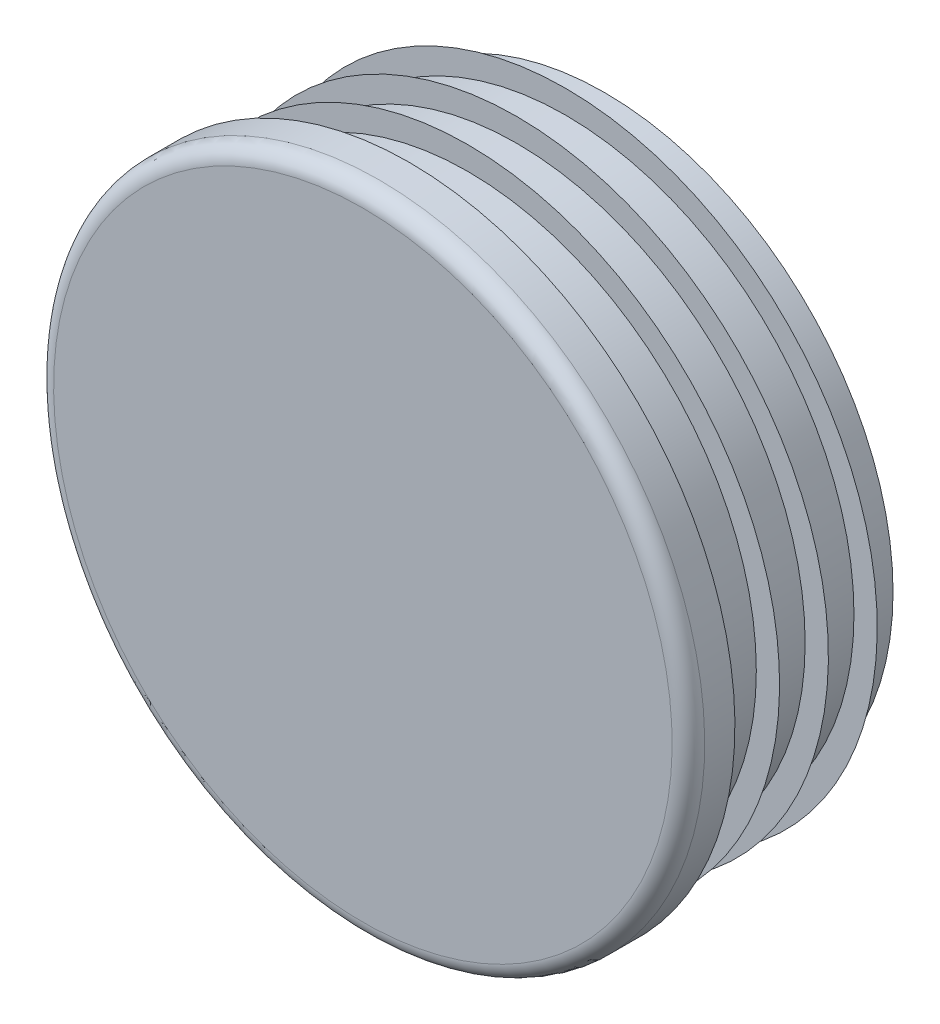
ISO-10303-21;
HEADER;
FILE_DESCRIPTION(('STEP AP214'),'2;1');
FILE_NAME('part.step','',(''),(''),'','','');
FILE_SCHEMA(('AUTOMOTIVE_DESIGN { 1 0 10303 214 1 1 1 1 }'));
ENDSEC;
DATA;
#1=APPLICATION_CONTEXT('core data for automotive mechanical design processes');
#2=APPLICATION_PROTOCOL_DEFINITION('international standard','automotive_design',2000,#1);
#3=PRODUCT_CONTEXT('',#1,'mechanical');
#4=PRODUCT('Part','Part','',(#3));
#5=PRODUCT_RELATED_PRODUCT_CATEGORY('part','',(#4));
#6=PRODUCT_DEFINITION_FORMATION('','',#4);
#7=PRODUCT_DEFINITION_CONTEXT('part definition',#1,'design');
#8=PRODUCT_DEFINITION('design','',#6,#7);
#9=PRODUCT_DEFINITION_SHAPE('','',#8);
#10=(LENGTH_UNIT() NAMED_UNIT(*) SI_UNIT(.MILLI.,.METRE.));
#11=(NAMED_UNIT(*) PLANE_ANGLE_UNIT() SI_UNIT($,.RADIAN.));
#12=(NAMED_UNIT(*) SI_UNIT($,.STERADIAN.) SOLID_ANGLE_UNIT());
#13=UNCERTAINTY_MEASURE_WITH_UNIT(LENGTH_MEASURE(1.E-05),#10,'distance_accuracy_value','');
#14=(GEOMETRIC_REPRESENTATION_CONTEXT(3) GLOBAL_UNCERTAINTY_ASSIGNED_CONTEXT((#13)) GLOBAL_UNIT_ASSIGNED_CONTEXT((#10,
#11,#12)) REPRESENTATION_CONTEXT('',''));
#15=CARTESIAN_POINT('',(0.,0.,0.));
#16=DIRECTION('',(0.,0.,1.));
#17=DIRECTION('',(1.,0.,0.));
#18=AXIS2_PLACEMENT_3D('',#15,#16,#17);
#19=CARTESIAN_POINT('',(0.,0.,5.));
#20=DIRECTION('',(0.,0.,-1.));
#21=DIRECTION('',(0.,1.,0.));
#22=AXIS2_PLACEMENT_3D('',#19,#20,#21);
#23=PLANE('',#22);
#24=CARTESIAN_POINT('',(0.,0.,5.));
#25=DIRECTION('',(0.,0.,-1.));
#26=DIRECTION('',(0.,1.,0.));
#27=AXIS2_PLACEMENT_3D('',#24,#25,#26);
#28=CIRCLE('',#27,33.25);
#29=CARTESIAN_POINT('',(0.,33.25,5.));
#30=VERTEX_POINT('',#29);
#31=EDGE_CURVE('E8',#30,#30,#28,.T.);
#32=ORIENTED_EDGE('',*,*,#31,.F.);
#33=EDGE_LOOP('',(#32));
#34=FACE_BOUND('',#33,.T.);
#35=ADVANCED_FACE('F12',(#34),#23,.F.);
#36=CARTESIAN_POINT('',(0.,0.,3.25));
#37=DIRECTION('',(0.,0.,-1.));
#38=DIRECTION('',(0.,1.,0.));
#39=AXIS2_PLACEMENT_3D('',#36,#37,#38);
#40=TOROIDAL_SURFACE('',#39,33.25,1.75);
#41=ORIENTED_EDGE('',*,*,#31,.T.);
#42=EDGE_LOOP('',(#41));
#43=FACE_BOUND('',#42,.T.);
#44=CARTESIAN_POINT('',(0.,0.,3.25000002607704));
#45=DIRECTION('',(0.,0.,-1.));
#46=DIRECTION('',(0.,1.,0.));
#47=AXIS2_PLACEMENT_3D('',#44,#45,#46);
#48=CIRCLE('',#47,35.);
#49=CARTESIAN_POINT('',(0.,35.,3.25000002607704));
#50=VERTEX_POINT('',#49);
#51=EDGE_CURVE('E18',#50,#50,#48,.T.);
#52=ORIENTED_EDGE('',*,*,#51,.F.);
#53=EDGE_LOOP('',(#52));
#54=FACE_BOUND('',#53,.T.);
#55=ADVANCED_FACE('F159',(#43,#54),#40,.T.);
#56=CARTESIAN_POINT('',(0.,0.,-21.));
#57=DIRECTION('',(0.,0.,-1.));
#58=DIRECTION('',(0.,1.,0.));
#59=AXIS2_PLACEMENT_3D('',#56,#57,#58);
#60=CYLINDRICAL_SURFACE('',#59,35.);
#61=CARTESIAN_POINT('',(0.,0.,0.));
#62=DIRECTION('',(0.,0.,-1.));
#63=DIRECTION('',(0.,1.,0.));
#64=AXIS2_PLACEMENT_3D('',#61,#62,#63);
#65=CIRCLE('',#64,35.);
#66=CARTESIAN_POINT('',(0.,35.,0.));
#67=VERTEX_POINT('',#66);
#68=EDGE_CURVE('E22',#67,#67,#65,.T.);
#69=ORIENTED_EDGE('',*,*,#68,.F.);
#70=EDGE_LOOP('',(#69));
#71=FACE_BOUND('',#70,.T.);
#72=ORIENTED_EDGE('',*,*,#51,.T.);
#73=EDGE_LOOP('',(#72));
#74=FACE_BOUND('',#73,.T.);
#75=ADVANCED_FACE('F154',(#71,#74),#60,.T.);
#76=CARTESIAN_POINT('',(35.,0.,0.));
#77=DIRECTION('',(0.,0.,1.));
#78=DIRECTION('',(0.,-1.,0.));
#79=AXIS2_PLACEMENT_3D('',#76,#77,#78);
#80=PLANE('',#79);
#81=CARTESIAN_POINT('',(0.,0.,0.));
#82=DIRECTION('',(0.,0.,-1.));
#83=DIRECTION('',(0.,1.,0.));
#84=AXIS2_PLACEMENT_3D('',#81,#82,#83);
#85=CIRCLE('',#84,31.);
#86=CARTESIAN_POINT('',(0.,31.,0.));
#87=VERTEX_POINT('',#86);
#88=EDGE_CURVE('E26',#87,#87,#85,.T.);
#89=ORIENTED_EDGE('',*,*,#88,.F.);
#90=EDGE_LOOP('',(#89));
#91=FACE_BOUND('',#90,.T.);
#92=ORIENTED_EDGE('',*,*,#68,.T.);
#93=EDGE_LOOP('',(#92));
#94=FACE_BOUND('',#93,.T.);
#95=ADVANCED_FACE('F148',(#91,#94),#80,.F.);
#96=CARTESIAN_POINT('',(0.,0.,-21.));
#97=DIRECTION('',(0.,0.,-1.));
#98=DIRECTION('',(0.,1.,0.));
#99=AXIS2_PLACEMENT_3D('',#96,#97,#98);
#100=CYLINDRICAL_SURFACE('',#99,31.);
#101=CARTESIAN_POINT('',(0.,0.,-1.05));
#102=DIRECTION('',(0.,0.,-1.));
#103=DIRECTION('',(0.,1.,0.));
#104=AXIS2_PLACEMENT_3D('',#101,#102,#103);
#105=CIRCLE('',#104,31.);
#106=CARTESIAN_POINT('',(0.,31.,-1.05));
#107=VERTEX_POINT('',#106);
#108=EDGE_CURVE('E31',#107,#107,#105,.T.);
#109=ORIENTED_EDGE('',*,*,#108,.F.);
#110=EDGE_LOOP('',(#109));
#111=FACE_BOUND('',#110,.T.);
#112=ORIENTED_EDGE('',*,*,#88,.T.);
#113=EDGE_LOOP('',(#112));
#114=FACE_BOUND('',#113,.T.);
#115=ADVANCED_FACE('F142',(#111,#114),#100,.T.);
#116=CARTESIAN_POINT('',(31.,0.,-1.05));
#117=DIRECTION('',(0.,0.,-1.));
#118=DIRECTION('',(0.,1.,0.));
#119=AXIS2_PLACEMENT_3D('',#116,#117,#118);
#120=PLANE('',#119);
#121=CARTESIAN_POINT('',(0.,0.,-1.05));
#122=DIRECTION('',(0.,0.,-1.));
#123=DIRECTION('',(0.,1.,0.));
#124=AXIS2_PLACEMENT_3D('',#121,#122,#123);
#125=CIRCLE('',#124,33.5);
#126=CARTESIAN_POINT('',(0.,33.5,-1.05));
#127=VERTEX_POINT('',#126);
#128=EDGE_CURVE('E34',#127,#127,#125,.T.);
#129=ORIENTED_EDGE('',*,*,#128,.F.);
#130=EDGE_LOOP('',(#129));
#131=FACE_BOUND('',#130,.T.);
#132=ORIENTED_EDGE('',*,*,#108,.T.);
#133=EDGE_LOOP('',(#132));
#134=FACE_BOUND('',#133,.T.);
#135=ADVANCED_FACE('F136',(#131,#134),#120,.F.);
#136=CARTESIAN_POINT('',(0.,0.,-1.05));
#137=DIRECTION('',(0.,0.,1.));
#138=DIRECTION('',(0.,-1.,0.));
#139=AXIS2_PLACEMENT_3D('',#136,#137,#138);
#140=CONICAL_SURFACE('',#139,33.5,0.959931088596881);
#141=CARTESIAN_POINT('',(0.,0.,-2.80051884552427));
#142=DIRECTION('',(0.,0.,-1.));
#143=DIRECTION('',(0.,1.,0.));
#144=AXIS2_PLACEMENT_3D('',#141,#142,#143);
#145=CIRCLE('',#144,31.);
#146=CARTESIAN_POINT('',(0.,31.,-2.80051884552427));
#147=VERTEX_POINT('',#146);
#148=EDGE_CURVE('E37',#147,#147,#145,.T.);
#149=ORIENTED_EDGE('',*,*,#148,.F.);
#150=EDGE_LOOP('',(#149));
#151=FACE_BOUND('',#150,.T.);
#152=ORIENTED_EDGE('',*,*,#128,.T.);
#153=EDGE_LOOP('',(#152));
#154=FACE_BOUND('',#153,.T.);
#155=ADVANCED_FACE('F130',(#151,#154),#140,.T.);
#156=CARTESIAN_POINT('',(0.,0.,-21.));
#157=DIRECTION('',(0.,0.,-1.));
#158=DIRECTION('',(0.,1.,0.));
#159=AXIS2_PLACEMENT_3D('',#156,#157,#158);
#160=CYLINDRICAL_SURFACE('',#159,31.);
#161=CARTESIAN_POINT('',(0.,0.,-6.3));
#162=DIRECTION('',(0.,0.,-1.));
#163=DIRECTION('',(0.,1.,0.));
#164=AXIS2_PLACEMENT_3D('',#161,#162,#163);
#165=CIRCLE('',#164,31.);
#166=CARTESIAN_POINT('',(0.,31.,-6.3));
#167=VERTEX_POINT('',#166);
#168=EDGE_CURVE('E40',#167,#167,#165,.T.);
#169=ORIENTED_EDGE('',*,*,#168,.F.);
#170=EDGE_LOOP('',(#169));
#171=FACE_BOUND('',#170,.T.);
#172=ORIENTED_EDGE('',*,*,#148,.T.);
#173=EDGE_LOOP('',(#172));
#174=FACE_BOUND('',#173,.T.);
#175=ADVANCED_FACE('F124',(#171,#174),#160,.T.);
#176=CARTESIAN_POINT('',(31.,0.,-6.3));
#177=DIRECTION('',(0.,0.,-1.));
#178=DIRECTION('',(0.,1.,0.));
#179=AXIS2_PLACEMENT_3D('',#176,#177,#178);
#180=PLANE('',#179);
#181=CARTESIAN_POINT('',(0.,0.,-6.3));
#182=DIRECTION('',(0.,0.,-1.));
#183=DIRECTION('',(0.,1.,0.));
#184=AXIS2_PLACEMENT_3D('',#181,#182,#183);
#185=CIRCLE('',#184,33.5);
#186=CARTESIAN_POINT('',(0.,33.5,-6.3));
#187=VERTEX_POINT('',#186);
#188=EDGE_CURVE('E43',#187,#187,#185,.T.);
#189=ORIENTED_EDGE('',*,*,#188,.F.);
#190=EDGE_LOOP('',(#189));
#191=FACE_BOUND('',#190,.T.);
#192=ORIENTED_EDGE('',*,*,#168,.T.);
#193=EDGE_LOOP('',(#192));
#194=FACE_BOUND('',#193,.T.);
#195=ADVANCED_FACE('F118',(#191,#194),#180,.F.);
#196=CARTESIAN_POINT('',(0.,0.,-6.3));
#197=DIRECTION('',(0.,0.,1.));
#198=DIRECTION('',(0.,-1.,0.));
#199=AXIS2_PLACEMENT_3D('',#196,#197,#198);
#200=CONICAL_SURFACE('',#199,33.5,0.959931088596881);
#201=CARTESIAN_POINT('',(0.,0.,-8.05051884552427));
#202=DIRECTION('',(0.,0.,-1.));
#203=DIRECTION('',(0.,1.,0.));
#204=AXIS2_PLACEMENT_3D('',#201,#202,#203);
#205=CIRCLE('',#204,31.);
#206=CARTESIAN_POINT('',(0.,31.,-8.05051884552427));
#207=VERTEX_POINT('',#206);
#208=EDGE_CURVE('E46',#207,#207,#205,.T.);
#209=ORIENTED_EDGE('',*,*,#208,.F.);
#210=EDGE_LOOP('',(#209));
#211=FACE_BOUND('',#210,.T.);
#212=ORIENTED_EDGE('',*,*,#188,.T.);
#213=EDGE_LOOP('',(#212));
#214=FACE_BOUND('',#213,.T.);
#215=ADVANCED_FACE('F112',(#211,#214),#200,.T.);
#216=CARTESIAN_POINT('',(0.,0.,-21.));
#217=DIRECTION('',(0.,0.,-1.));
#218=DIRECTION('',(0.,1.,0.));
#219=AXIS2_PLACEMENT_3D('',#216,#217,#218);
#220=CYLINDRICAL_SURFACE('',#219,31.);
#221=CARTESIAN_POINT('',(0.,0.,-11.55));
#222=DIRECTION('',(0.,0.,-1.));
#223=DIRECTION('',(0.,1.,0.));
#224=AXIS2_PLACEMENT_3D('',#221,#222,#223);
#225=CIRCLE('',#224,31.);
#226=CARTESIAN_POINT('',(0.,31.,-11.55));
#227=VERTEX_POINT('',#226);
#228=EDGE_CURVE('E49',#227,#227,#225,.T.);
#229=ORIENTED_EDGE('',*,*,#228,.F.);
#230=EDGE_LOOP('',(#229));
#231=FACE_BOUND('',#230,.T.);
#232=ORIENTED_EDGE('',*,*,#208,.T.);
#233=EDGE_LOOP('',(#232));
#234=FACE_BOUND('',#233,.T.);
#235=ADVANCED_FACE('F106',(#231,#234),#220,.T.);
#236=CARTESIAN_POINT('',(31.,0.,-11.55));
#237=DIRECTION('',(0.,0.,-1.));
#238=DIRECTION('',(0.,1.,0.));
#239=AXIS2_PLACEMENT_3D('',#236,#237,#238);
#240=PLANE('',#239);
#241=CARTESIAN_POINT('',(0.,0.,-11.55));
#242=DIRECTION('',(0.,0.,-1.));
#243=DIRECTION('',(0.,1.,0.));
#244=AXIS2_PLACEMENT_3D('',#241,#242,#243);
#245=CIRCLE('',#244,33.5);
#246=CARTESIAN_POINT('',(0.,33.5,-11.55));
#247=VERTEX_POINT('',#246);
#248=EDGE_CURVE('E52',#247,#247,#245,.T.);
#249=ORIENTED_EDGE('',*,*,#248,.F.);
#250=EDGE_LOOP('',(#249));
#251=FACE_BOUND('',#250,.T.);
#252=ORIENTED_EDGE('',*,*,#228,.T.);
#253=EDGE_LOOP('',(#252));
#254=FACE_BOUND('',#253,.T.);
#255=ADVANCED_FACE('F100',(#251,#254),#240,.F.);
#256=CARTESIAN_POINT('',(0.,0.,-11.55));
#257=DIRECTION('',(0.,0.,1.));
#258=DIRECTION('',(0.,-1.,0.));
#259=AXIS2_PLACEMENT_3D('',#256,#257,#258);
#260=CONICAL_SURFACE('',#259,33.5,0.959931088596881);
#261=CARTESIAN_POINT('',(0.,0.,-13.3005188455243));
#262=DIRECTION('',(0.,0.,-1.));
#263=DIRECTION('',(0.,1.,0.));
#264=AXIS2_PLACEMENT_3D('',#261,#262,#263);
#265=CIRCLE('',#264,31.);
#266=CARTESIAN_POINT('',(0.,31.,-13.3005188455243));
#267=VERTEX_POINT('',#266);
#268=EDGE_CURVE('E55',#267,#267,#265,.T.);
#269=ORIENTED_EDGE('',*,*,#268,.F.);
#270=EDGE_LOOP('',(#269));
#271=FACE_BOUND('',#270,.T.);
#272=ORIENTED_EDGE('',*,*,#248,.T.);
#273=EDGE_LOOP('',(#272));
#274=FACE_BOUND('',#273,.T.);
#275=ADVANCED_FACE('F94',(#271,#274),#260,.T.);
#276=CARTESIAN_POINT('',(0.,0.,-21.));
#277=DIRECTION('',(0.,0.,-1.));
#278=DIRECTION('',(0.,1.,0.));
#279=AXIS2_PLACEMENT_3D('',#276,#277,#278);
#280=CYLINDRICAL_SURFACE('',#279,31.);
#281=CARTESIAN_POINT('',(0.,0.,-16.8));
#282=DIRECTION('',(0.,0.,-1.));
#283=DIRECTION('',(0.,1.,0.));
#284=AXIS2_PLACEMENT_3D('',#281,#282,#283);
#285=CIRCLE('',#284,31.);
#286=CARTESIAN_POINT('',(0.,31.,-16.8));
#287=VERTEX_POINT('',#286);
#288=EDGE_CURVE('E58',#287,#287,#285,.T.);
#289=ORIENTED_EDGE('',*,*,#288,.F.);
#290=EDGE_LOOP('',(#289));
#291=FACE_BOUND('',#290,.T.);
#292=ORIENTED_EDGE('',*,*,#268,.T.);
#293=EDGE_LOOP('',(#292));
#294=FACE_BOUND('',#293,.T.);
#295=ADVANCED_FACE('F88',(#291,#294),#280,.T.);
#296=CARTESIAN_POINT('',(31.,0.,-16.8));
#297=DIRECTION('',(0.,0.,-1.));
#298=DIRECTION('',(0.,1.,0.));
#299=AXIS2_PLACEMENT_3D('',#296,#297,#298);
#300=PLANE('',#299);
#301=CARTESIAN_POINT('',(0.,0.,-16.8));
#302=DIRECTION('',(0.,0.,-1.));
#303=DIRECTION('',(0.,1.,0.));
#304=AXIS2_PLACEMENT_3D('',#301,#302,#303);
#305=CIRCLE('',#304,33.5);
#306=CARTESIAN_POINT('',(0.,33.5,-16.8));
#307=VERTEX_POINT('',#306);
#308=EDGE_CURVE('E61',#307,#307,#305,.T.);
#309=ORIENTED_EDGE('',*,*,#308,.F.);
#310=EDGE_LOOP('',(#309));
#311=FACE_BOUND('',#310,.T.);
#312=ORIENTED_EDGE('',*,*,#288,.T.);
#313=EDGE_LOOP('',(#312));
#314=FACE_BOUND('',#313,.T.);
#315=ADVANCED_FACE('F82',(#311,#314),#300,.F.);
#316=CARTESIAN_POINT('',(0.,0.,-16.8));
#317=DIRECTION('',(0.,0.,1.));
#318=DIRECTION('',(0.,-1.,0.));
#319=AXIS2_PLACEMENT_3D('',#316,#317,#318);
#320=CONICAL_SURFACE('',#319,33.5,0.959931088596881);
#321=CARTESIAN_POINT('',(0.,0.,-18.5505188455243));
#322=DIRECTION('',(0.,0.,-1.));
#323=DIRECTION('',(0.,1.,0.));
#324=AXIS2_PLACEMENT_3D('',#321,#322,#323);
#325=CIRCLE('',#324,31.);
#326=CARTESIAN_POINT('',(0.,31.,-18.5505188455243));
#327=VERTEX_POINT('',#326);
#328=EDGE_CURVE('E64',#327,#327,#325,.T.);
#329=ORIENTED_EDGE('',*,*,#328,.F.);
#330=EDGE_LOOP('',(#329));
#331=FACE_BOUND('',#330,.T.);
#332=ORIENTED_EDGE('',*,*,#308,.T.);
#333=EDGE_LOOP('',(#332));
#334=FACE_BOUND('',#333,.T.);
#335=ADVANCED_FACE('F76',(#331,#334),#320,.T.);
#336=CARTESIAN_POINT('',(0.,0.,-21.));
#337=DIRECTION('',(0.,0.,-1.));
#338=DIRECTION('',(0.,1.,0.));
#339=AXIS2_PLACEMENT_3D('',#336,#337,#338);
#340=CYLINDRICAL_SURFACE('',#339,31.);
#341=CARTESIAN_POINT('',(0.,0.,-21.));
#342=DIRECTION('',(0.,0.,-1.));
#343=DIRECTION('',(0.,1.,0.));
#344=AXIS2_PLACEMENT_3D('',#341,#342,#343);
#345=CIRCLE('',#344,31.);
#346=CARTESIAN_POINT('',(0.,31.,-21.));
#347=VERTEX_POINT('',#346);
#348=EDGE_CURVE('E67',#347,#347,#345,.T.);
#349=ORIENTED_EDGE('',*,*,#348,.F.);
#350=EDGE_LOOP('',(#349));
#351=FACE_BOUND('',#350,.T.);
#352=ORIENTED_EDGE('',*,*,#328,.T.);
#353=EDGE_LOOP('',(#352));
#354=FACE_BOUND('',#353,.T.);
#355=ADVANCED_FACE('F73',(#351,#354),#340,.T.);
#356=CARTESIAN_POINT('',(31.,0.,-21.));
#357=DIRECTION('',(0.,0.,1.));
#358=DIRECTION('',(0.,-1.,0.));
#359=AXIS2_PLACEMENT_3D('',#356,#357,#358);
#360=PLANE('',#359);
#361=ORIENTED_EDGE('',*,*,#348,.T.);
#362=EDGE_LOOP('',(#361));
#363=FACE_BOUND('',#362,.T.);
#364=ADVANCED_FACE('F71',(#363),#360,.F.);
#365=CLOSED_SHELL('',(#35,#55,#75,#95,#115,#135,#155,#175,#195,#215,#235,#255,#275,#295,#315,
#335,#355,#364));
#366=MANIFOLD_SOLID_BREP('B1',#365);
#367=ADVANCED_BREP_SHAPE_REPRESENTATION('',(#18,#366),#14);
#368=SHAPE_DEFINITION_REPRESENTATION(#9,#367);
ENDSEC;
END-ISO-10303-21;
